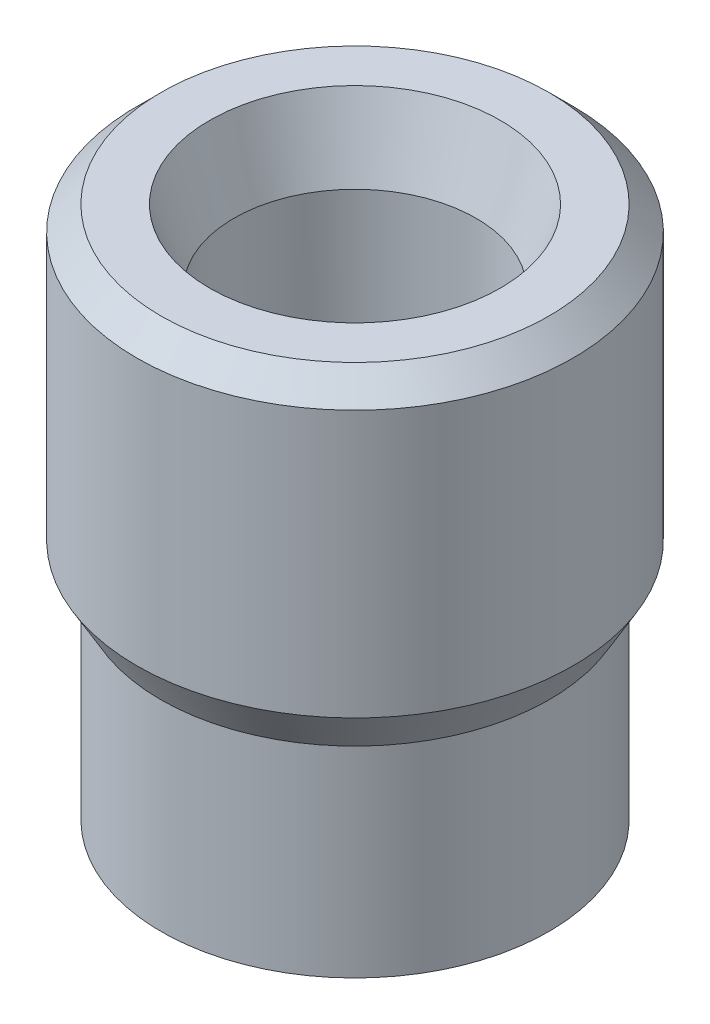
from build123d import *

# Parameters (mm, degrees)
SKICA1_R                 = 8
P_IDAT_VYSUNUT_M1_DEPTH  = 8.3
SKICA2_R                 = 9
P_IDAT_VYSUNUT_M2_DEPTH  = 13.7
ZKOSEN_1_SIZE            = 1.7
ZKOSEN_1_SIZE2           = 0.981495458
ZKOSEN_2_SIZE            = 1
SKICA3_R                 = 3
ODEBRAT_VYSUNUT_M1_DEPTH = 11
SKICA4_R                 = 5
ODEBRAT_VYSUNUT_M2_DEPTH = 11
ZKOSEN_3_SIZE            = 1
ZKOSEN_3_SIZE2           = 3


with BuildPart() as part:
    # Skica1 → P_idat vysunut_m1 (new body)
    with BuildSketch(Plane(origin=(0, 0, 0), x_dir=(1, 0, 0), z_dir=(0, 1, 0))):
        with Locations(Location((0, 0, 0), (0, 0, 90))):
            Circle(SKICA1_R)
    extrude(amount=P_IDAT_VYSUNUT_M1_DEPTH)

    # Skica2 → P_idat vysunut_m2 (add)
    with BuildSketch(Plane(origin=(0, 8.3, 0), x_dir=(-1, 0, 0), z_dir=(0, 1, 0))):
        with Locations(Location((0, 0, 0), (0, 0, 270))):
            Circle(SKICA2_R)
    extrude(amount=P_IDAT_VYSUNUT_M2_DEPTH)

    # Zkosen_1
    zkosen_1_edges = [part.edges().sort_by_distance(p)[0] for p in [
        (0, 8.3, 9),
    ]]
    zkosen_1_side = [part.faces().sort_by_distance(p)[0] for p in [
        (0, 15.15, 9),
    ]]
    chamfer(zkosen_1_edges, length=ZKOSEN_1_SIZE, length2=ZKOSEN_1_SIZE2, reference=zkosen_1_side[0])

    # Zkosen_2
    zkosen_2_edges = [part.edges().sort_by_distance(p)[0] for p in [
        (0, 22, 9),
    ]]
    chamfer(zkosen_2_edges, length=ZKOSEN_2_SIZE)

    # Skica3 → Odebrat vysunut_m1 (cut)
    with BuildSketch(Plane.XZ):
        with Locations(Location((0, 0, 0), (0, 0, 270))):
            Circle(SKICA3_R)
    extrude(amount=-ODEBRAT_VYSUNUT_M1_DEPTH, mode=Mode.SUBTRACT)

    # Skica4 → Odebrat vysunut_m2 (cut)
    with BuildSketch(Plane(origin=(0, 22, 0), x_dir=(1, 0, 0), z_dir=(0, 1, 0))):
        with Locations(Location((0, 0, 0), (0, 0, 270))):
            Circle(SKICA4_R)
    extrude(amount=-ODEBRAT_VYSUNUT_M2_DEPTH, mode=Mode.SUBTRACT)

    # Zkosen_3
    zkosen_3_edges = [part.edges().sort_by_distance(p)[0] for p in [
        (0, 22, -5),
    ]]
    zkosen_3_side = [part.faces().sort_by_distance(p)[0] for p in [
        (0, 22, 7.77372583),
    ]]
    chamfer(zkosen_3_edges, length=ZKOSEN_3_SIZE, length2=ZKOSEN_3_SIZE2, reference=zkosen_3_side[0])


solid = part.part
